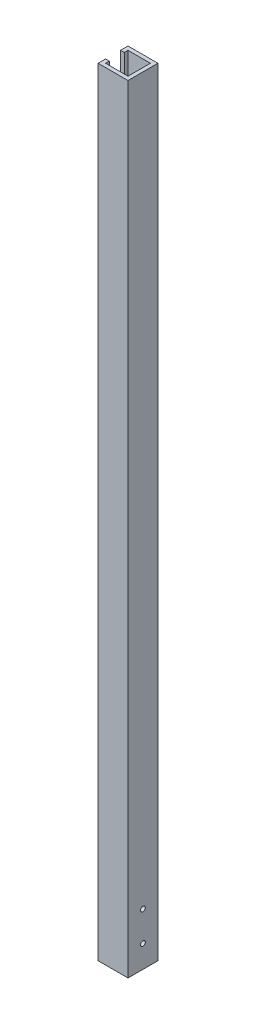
ISO-10303-21;
HEADER;
FILE_DESCRIPTION(('STEP AP214'),'2;1');
FILE_NAME('part.step','',(''),(''),'','','');
FILE_SCHEMA(('AUTOMOTIVE_DESIGN { 1 0 10303 214 1 1 1 1 }'));
ENDSEC;
DATA;
#1=APPLICATION_CONTEXT('core data for automotive mechanical design processes');
#2=APPLICATION_PROTOCOL_DEFINITION('international standard','automotive_design',2000,#1);
#3=PRODUCT_CONTEXT('',#1,'mechanical');
#4=PRODUCT('Part','Part','',(#3));
#5=PRODUCT_RELATED_PRODUCT_CATEGORY('part','',(#4));
#6=PRODUCT_DEFINITION_FORMATION('','',#4);
#7=PRODUCT_DEFINITION_CONTEXT('part definition',#1,'design');
#8=PRODUCT_DEFINITION('design','',#6,#7);
#9=PRODUCT_DEFINITION_SHAPE('','',#8);
#10=(LENGTH_UNIT() NAMED_UNIT(*) SI_UNIT(.MILLI.,.METRE.));
#11=(NAMED_UNIT(*) PLANE_ANGLE_UNIT() SI_UNIT($,.RADIAN.));
#12=(NAMED_UNIT(*) SI_UNIT($,.STERADIAN.) SOLID_ANGLE_UNIT());
#13=UNCERTAINTY_MEASURE_WITH_UNIT(LENGTH_MEASURE(1.E-05),#10,'distance_accuracy_value','');
#14=(GEOMETRIC_REPRESENTATION_CONTEXT(3) GLOBAL_UNCERTAINTY_ASSIGNED_CONTEXT((#13)) GLOBAL_UNIT_ASSIGNED_CONTEXT((#10,
#11,#12)) REPRESENTATION_CONTEXT('',''));
#15=CARTESIAN_POINT('',(0.,0.,0.));
#16=DIRECTION('',(0.,0.,1.));
#17=DIRECTION('',(1.,0.,0.));
#18=AXIS2_PLACEMENT_3D('',#15,#16,#17);
#19=CARTESIAN_POINT('',(0.,660.4,0.));
#20=DIRECTION('',(0.,-1.,0.));
#21=DIRECTION('',(0.,0.,-1.));
#22=AXIS2_PLACEMENT_3D('',#19,#20,#21);
#23=PLANE('',#22);
#24=DIRECTION('',(0.,0.,1.));
#25=VECTOR('',#24,1.);
#26=CARTESIAN_POINT('',(-9.525,660.4,9.525));
#27=LINE('',#26,#25);
#28=CARTESIAN_POINT('',(-9.525,660.4,6.34999999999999));
#29=VERTEX_POINT('',#28);
#30=CARTESIAN_POINT('',(-9.525,660.4,9.525));
#31=VERTEX_POINT('',#30);
#32=EDGE_CURVE('E228',#29,#31,#27,.T.);
#33=ORIENTED_EDGE('',*,*,#32,.F.);
#34=DIRECTION('',(-1.,0.,0.));
#35=VECTOR('',#34,1.);
#36=CARTESIAN_POINT('',(-9.525,660.4,6.34999999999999));
#37=LINE('',#36,#35);
#38=CARTESIAN_POINT('',(-12.7,660.4,6.34999999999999));
#39=VERTEX_POINT('',#38);
#40=EDGE_CURVE('E312',#29,#39,#37,.T.);
#41=ORIENTED_EDGE('',*,*,#40,.T.);
#42=DIRECTION('',(0.,0.,1.));
#43=VECTOR('',#42,1.);
#44=CARTESIAN_POINT('',(-12.7,660.4,12.7));
#45=LINE('',#44,#43);
#46=CARTESIAN_POINT('',(-12.7,660.4,12.7));
#47=VERTEX_POINT('',#46);
#48=EDGE_CURVE('E262',#39,#47,#45,.T.);
#49=ORIENTED_EDGE('',*,*,#48,.T.);
#50=DIRECTION('',(1.,0.,0.));
#51=VECTOR('',#50,1.);
#52=CARTESIAN_POINT('',(-12.7,660.4,12.7));
#53=LINE('',#52,#51);
#54=CARTESIAN_POINT('',(12.7,660.4,12.7));
#55=VERTEX_POINT('',#54);
#56=EDGE_CURVE('E199',#47,#55,#53,.T.);
#57=ORIENTED_EDGE('',*,*,#56,.T.);
#58=DIRECTION('',(0.,0.,-1.));
#59=VECTOR('',#58,1.);
#60=CARTESIAN_POINT('',(12.7,660.4,12.7));
#61=LINE('',#60,#59);
#62=CARTESIAN_POINT('',(12.7,660.4,-12.7));
#63=VERTEX_POINT('',#62);
#64=EDGE_CURVE('E194',#55,#63,#61,.T.);
#65=ORIENTED_EDGE('',*,*,#64,.T.);
#66=DIRECTION('',(-1.,0.,0.));
#67=VECTOR('',#66,1.);
#68=CARTESIAN_POINT('',(-12.7,660.4,-12.7));
#69=LINE('',#68,#67);
#70=CARTESIAN_POINT('',(-12.7,660.4,-12.7));
#71=VERTEX_POINT('',#70);
#72=EDGE_CURVE('E260',#63,#71,#69,.T.);
#73=ORIENTED_EDGE('',*,*,#72,.T.);
#74=CARTESIAN_POINT('',(-12.7,660.4,-6.35));
#75=VERTEX_POINT('',#74);
#76=EDGE_CURVE('E263',#71,#75,#45,.T.);
#77=ORIENTED_EDGE('',*,*,#76,.T.);
#78=DIRECTION('',(-1.,0.,0.));
#79=VECTOR('',#78,1.);
#80=CARTESIAN_POINT('',(-9.525,660.4,-6.35));
#81=LINE('',#80,#79);
#82=CARTESIAN_POINT('',(-9.525,660.4,-6.35));
#83=VERTEX_POINT('',#82);
#84=EDGE_CURVE('E329',#83,#75,#81,.T.);
#85=ORIENTED_EDGE('',*,*,#84,.F.);
#86=CARTESIAN_POINT('',(-9.525,660.4,-9.525));
#87=VERTEX_POINT('',#86);
#88=EDGE_CURVE('E224',#87,#83,#27,.T.);
#89=ORIENTED_EDGE('',*,*,#88,.F.);
#90=DIRECTION('',(-1.,0.,0.));
#91=VECTOR('',#90,1.);
#92=CARTESIAN_POINT('',(-9.525,660.4,-9.525));
#93=LINE('',#92,#91);
#94=CARTESIAN_POINT('',(9.525,660.4,-9.52500000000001));
#95=VERTEX_POINT('',#94);
#96=EDGE_CURVE('E233',#95,#87,#93,.T.);
#97=ORIENTED_EDGE('',*,*,#96,.F.);
#98=DIRECTION('',(0.,0.,-1.));
#99=VECTOR('',#98,1.);
#100=CARTESIAN_POINT('',(9.525,660.4,9.525));
#101=LINE('',#100,#99);
#102=CARTESIAN_POINT('',(9.525,660.4,9.525));
#103=VERTEX_POINT('',#102);
#104=EDGE_CURVE('E230',#103,#95,#101,.T.);
#105=ORIENTED_EDGE('',*,*,#104,.F.);
#106=DIRECTION('',(1.,0.,0.));
#107=VECTOR('',#106,1.);
#108=CARTESIAN_POINT('',(-9.525,660.4,9.525));
#109=LINE('',#108,#107);
#110=EDGE_CURVE('E227',#31,#103,#109,.T.);
#111=ORIENTED_EDGE('',*,*,#110,.F.);
#112=EDGE_LOOP('',(#33,#41,#49,#57,#65,#73,#77,#85,#89,#97,#105,#111));
#113=FACE_BOUND('',#112,.T.);
#114=ADVANCED_FACE('F40',(#113),#23,.F.);
#115=CARTESIAN_POINT('',(0.,0.,0.));
#116=DIRECTION('',(0.,-1.,0.));
#117=DIRECTION('',(0.,0.,-1.));
#118=AXIS2_PLACEMENT_3D('',#115,#116,#117);
#119=PLANE('',#118);
#120=DIRECTION('',(0.,0.,1.));
#121=VECTOR('',#120,1.);
#122=CARTESIAN_POINT('',(-8.89,0.,12.701));
#123=LINE('',#122,#121);
#124=CARTESIAN_POINT('',(-8.89,0.,-12.7));
#125=VERTEX_POINT('',#124);
#126=CARTESIAN_POINT('',(-8.89,0.,-9.525));
#127=VERTEX_POINT('',#126);
#128=EDGE_CURVE('E179',#125,#127,#123,.T.);
#129=ORIENTED_EDGE('',*,*,#128,.T.);
#130=DIRECTION('',(-1.,0.,0.));
#131=VECTOR('',#130,1.);
#132=CARTESIAN_POINT('',(-9.525,0.,-9.525));
#133=LINE('',#132,#131);
#134=CARTESIAN_POINT('',(-9.525,0.,-9.525));
#135=VERTEX_POINT('',#134);
#136=EDGE_CURVE('E243',#127,#135,#133,.T.);
#137=ORIENTED_EDGE('',*,*,#136,.T.);
#138=DIRECTION('',(0.,0.,1.));
#139=VECTOR('',#138,1.);
#140=CARTESIAN_POINT('',(-9.525,0.,9.525));
#141=LINE('',#140,#139);
#142=CARTESIAN_POINT('',(-9.525,0.,9.525));
#143=VERTEX_POINT('',#142);
#144=EDGE_CURVE('E212',#135,#143,#141,.T.);
#145=ORIENTED_EDGE('',*,*,#144,.T.);
#146=DIRECTION('',(1.,0.,0.));
#147=VECTOR('',#146,1.);
#148=CARTESIAN_POINT('',(-9.525,0.,9.525));
#149=LINE('',#148,#147);
#150=CARTESIAN_POINT('',(9.525,0.,9.525));
#151=VERTEX_POINT('',#150);
#152=EDGE_CURVE('E238',#143,#151,#149,.T.);
#153=ORIENTED_EDGE('',*,*,#152,.T.);
#154=DIRECTION('',(0.,0.,-1.));
#155=VECTOR('',#154,1.);
#156=CARTESIAN_POINT('',(9.525,0.,9.525));
#157=LINE('',#156,#155);
#158=CARTESIAN_POINT('',(9.525,0.,-9.52500000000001));
#159=VERTEX_POINT('',#158);
#160=EDGE_CURVE('E241',#151,#159,#157,.T.);
#161=ORIENTED_EDGE('',*,*,#160,.T.);
#162=CARTESIAN_POINT('',(8.88999999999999,0.,-9.52500000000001));
#163=VERTEX_POINT('',#162);
#164=EDGE_CURVE('E177',#159,#163,#133,.T.);
#165=ORIENTED_EDGE('',*,*,#164,.T.);
#166=DIRECTION('',(0.,0.,-1.));
#167=VECTOR('',#166,1.);
#168=CARTESIAN_POINT('',(8.89,0.,12.701));
#169=LINE('',#168,#167);
#170=CARTESIAN_POINT('',(8.89,0.,-12.7));
#171=VERTEX_POINT('',#170);
#172=EDGE_CURVE('E58',#163,#171,#169,.T.);
#173=ORIENTED_EDGE('',*,*,#172,.T.);
#174=DIRECTION('',(-1.,0.,0.));
#175=VECTOR('',#174,1.);
#176=CARTESIAN_POINT('',(-12.7,0.,-12.7));
#177=LINE('',#176,#175);
#178=CARTESIAN_POINT('',(12.7,0.,-12.7));
#179=VERTEX_POINT('',#178);
#180=EDGE_CURVE('E174',#179,#171,#177,.T.);
#181=ORIENTED_EDGE('',*,*,#180,.F.);
#182=DIRECTION('',(0.,0.,-1.));
#183=VECTOR('',#182,1.);
#184=CARTESIAN_POINT('',(12.7,0.,12.7));
#185=LINE('',#184,#183);
#186=CARTESIAN_POINT('',(12.7,0.,12.7));
#187=VERTEX_POINT('',#186);
#188=EDGE_CURVE('E189',#187,#179,#185,.T.);
#189=ORIENTED_EDGE('',*,*,#188,.F.);
#190=DIRECTION('',(1.,0.,0.));
#191=VECTOR('',#190,1.);
#192=CARTESIAN_POINT('',(-12.7,0.,12.7));
#193=LINE('',#192,#191);
#194=CARTESIAN_POINT('',(-12.7,0.,12.7));
#195=VERTEX_POINT('',#194);
#196=EDGE_CURVE('E187',#195,#187,#193,.T.);
#197=ORIENTED_EDGE('',*,*,#196,.F.);
#198=DIRECTION('',(0.,0.,1.));
#199=VECTOR('',#198,1.);
#200=CARTESIAN_POINT('',(-12.7,0.,12.7));
#201=LINE('',#200,#199);
#202=CARTESIAN_POINT('',(-12.7,0.,-12.7));
#203=VERTEX_POINT('',#202);
#204=EDGE_CURVE('E184',#203,#195,#201,.T.);
#205=ORIENTED_EDGE('',*,*,#204,.F.);
#206=EDGE_CURVE('E185',#125,#203,#177,.T.);
#207=ORIENTED_EDGE('',*,*,#206,.F.);
#208=EDGE_LOOP('',(#129,#137,#145,#153,#161,#165,#173,#181,#189,#197,#205,#207));
#209=FACE_BOUND('',#208,.T.);
#210=ADVANCED_FACE('F172',(#209),#119,.T.);
#211=CARTESIAN_POINT('',(12.7,660.4,12.7));
#212=DIRECTION('',(-1.,0.,0.));
#213=DIRECTION('',(0.,0.,1.));
#214=AXIS2_PLACEMENT_3D('',#211,#212,#213);
#215=PLANE('',#214);
#216=CARTESIAN_POINT('',(12.7,44.45,0.));
#217=DIRECTION('',(1.,0.,0.));
#218=DIRECTION('',(0.,0.,-1.));
#219=AXIS2_PLACEMENT_3D('',#216,#217,#218);
#220=CIRCLE('',#219,2.01929999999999);
#221=CARTESIAN_POINT('',(12.7,44.45,-2.01929999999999));
#222=VERTEX_POINT('',#221);
#223=EDGE_CURVE('E325',#222,#222,#220,.T.);
#224=ORIENTED_EDGE('',*,*,#223,.F.);
#225=EDGE_LOOP('',(#224));
#226=FACE_BOUND('',#225,.T.);
#227=CARTESIAN_POINT('',(12.7,19.05,0.));
#228=DIRECTION('',(1.,0.,0.));
#229=DIRECTION('',(0.,0.,-1.));
#230=AXIS2_PLACEMENT_3D('',#227,#228,#229);
#231=CIRCLE('',#230,2.01929999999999);
#232=CARTESIAN_POINT('',(12.7,19.05,-2.01929999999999));
#233=VERTEX_POINT('',#232);
#234=EDGE_CURVE('E215',#233,#233,#231,.T.);
#235=ORIENTED_EDGE('',*,*,#234,.F.);
#236=EDGE_LOOP('',(#235));
#237=FACE_BOUND('',#236,.T.);
#238=ORIENTED_EDGE('',*,*,#188,.T.);
#239=DIRECTION('',(0.,-1.,0.));
#240=VECTOR('',#239,1.);
#241=CARTESIAN_POINT('',(12.7,660.4,-12.7));
#242=LINE('',#241,#240);
#243=EDGE_CURVE('E11',#63,#179,#242,.T.);
#244=ORIENTED_EDGE('',*,*,#243,.F.);
#245=ORIENTED_EDGE('',*,*,#64,.F.);
#246=DIRECTION('',(0.,-1.,0.));
#247=VECTOR('',#246,1.);
#248=CARTESIAN_POINT('',(12.7,660.4,12.7));
#249=LINE('',#248,#247);
#250=EDGE_CURVE('E195',#55,#187,#249,.T.);
#251=ORIENTED_EDGE('',*,*,#250,.T.);
#252=EDGE_LOOP('',(#238,#244,#245,#251));
#253=FACE_BOUND('',#252,.T.);
#254=ADVANCED_FACE('F42',(#226,#237,#253),#215,.F.);
#255=CARTESIAN_POINT('',(-12.7,660.4,-12.7));
#256=DIRECTION('',(0.,0.,1.));
#257=DIRECTION('',(1.,0.,0.));
#258=AXIS2_PLACEMENT_3D('',#255,#256,#257);
#259=PLANE('',#258);
#260=CARTESIAN_POINT('',(0.,25.4,-12.7));
#261=DIRECTION('',(0.,0.,-1.));
#262=DIRECTION('',(-1.,0.,0.));
#263=AXIS2_PLACEMENT_3D('',#260,#261,#262);
#264=CIRCLE('',#263,8.89);
#265=CARTESIAN_POINT('',(-8.89,25.4,-12.7));
#266=VERTEX_POINT('',#265);
#267=CARTESIAN_POINT('',(8.89,25.4,-12.7));
#268=VERTEX_POINT('',#267);
#269=EDGE_CURVE('E167',#266,#268,#264,.T.);
#270=ORIENTED_EDGE('',*,*,#269,.F.);
#271=DIRECTION('',(0.,1.,0.));
#272=VECTOR('',#271,1.);
#273=CARTESIAN_POINT('',(-8.89,0.,-12.7));
#274=LINE('',#273,#272);
#275=EDGE_CURVE('E286',#125,#266,#274,.T.);
#276=ORIENTED_EDGE('',*,*,#275,.F.);
#277=ORIENTED_EDGE('',*,*,#206,.T.);
#278=DIRECTION('',(0.,-1.,0.));
#279=VECTOR('',#278,1.);
#280=CARTESIAN_POINT('',(-12.7,660.4,-12.7));
#281=LINE('',#280,#279);
#282=EDGE_CURVE('E50',#71,#203,#281,.T.);
#283=ORIENTED_EDGE('',*,*,#282,.F.);
#284=ORIENTED_EDGE('',*,*,#72,.F.);
#285=ORIENTED_EDGE('',*,*,#243,.T.);
#286=ORIENTED_EDGE('',*,*,#180,.T.);
#287=DIRECTION('',(0.,-1.,0.));
#288=VECTOR('',#287,1.);
#289=CARTESIAN_POINT('',(8.89,0.,-12.7));
#290=LINE('',#289,#288);
#291=EDGE_CURVE('E158',#268,#171,#290,.T.);
#292=ORIENTED_EDGE('',*,*,#291,.F.);
#293=EDGE_LOOP('',(#270,#276,#277,#283,#284,#285,#286,#292));
#294=FACE_BOUND('',#293,.T.);
#295=ADVANCED_FACE('F181',(#294),#259,.F.);
#296=CARTESIAN_POINT('',(-12.7,660.4,12.7));
#297=DIRECTION('',(1.,0.,0.));
#298=DIRECTION('',(0.,0.,-1.));
#299=AXIS2_PLACEMENT_3D('',#296,#297,#298);
#300=PLANE('',#299);
#301=CARTESIAN_POINT('',(-12.7,44.45,0.));
#302=DIRECTION('',(1.,0.,0.));
#303=DIRECTION('',(0.,0.,-1.));
#304=AXIS2_PLACEMENT_3D('',#301,#302,#303);
#305=CIRCLE('',#304,2.01929999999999);
#306=CARTESIAN_POINT('',(-12.7,44.45,-2.01929999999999));
#307=VERTEX_POINT('',#306);
#308=EDGE_CURVE('E334',#307,#307,#305,.T.);
#309=ORIENTED_EDGE('',*,*,#308,.T.);
#310=EDGE_LOOP('',(#309));
#311=FACE_BOUND('',#310,.T.);
#312=CARTESIAN_POINT('',(-12.7,19.05,0.));
#313=DIRECTION('',(1.,0.,0.));
#314=DIRECTION('',(0.,0.,-1.));
#315=AXIS2_PLACEMENT_3D('',#312,#313,#314);
#316=CIRCLE('',#315,2.01929999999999);
#317=CARTESIAN_POINT('',(-12.7,19.05,-2.01929999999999));
#318=VERTEX_POINT('',#317);
#319=EDGE_CURVE('E208',#318,#318,#316,.T.);
#320=ORIENTED_EDGE('',*,*,#319,.T.);
#321=EDGE_LOOP('',(#320));
#322=FACE_BOUND('',#321,.T.);
#323=ORIENTED_EDGE('',*,*,#48,.F.);
#324=DIRECTION('',(0.,1.,0.));
#325=VECTOR('',#324,1.);
#326=CARTESIAN_POINT('',(-12.7,660.4,6.34999999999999));
#327=LINE('',#326,#325);
#328=CARTESIAN_POINT('',(-12.7,596.9,6.35));
#329=VERTEX_POINT('',#328);
#330=EDGE_CURVE('E300',#329,#39,#327,.T.);
#331=ORIENTED_EDGE('',*,*,#330,.F.);
#332=DIRECTION('',(0.,0.,1.));
#333=VECTOR('',#332,1.);
#334=CARTESIAN_POINT('',(-12.7,596.9,6.35));
#335=LINE('',#334,#333);
#336=CARTESIAN_POINT('',(-12.7,596.9,-6.34999999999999));
#337=VERTEX_POINT('',#336);
#338=EDGE_CURVE('E306',#337,#329,#335,.T.);
#339=ORIENTED_EDGE('',*,*,#338,.F.);
#340=DIRECTION('',(0.,-1.,0.));
#341=VECTOR('',#340,1.);
#342=CARTESIAN_POINT('',(-12.7,660.4,-6.35));
#343=LINE('',#342,#341);
#344=EDGE_CURVE('E315',#75,#337,#343,.T.);
#345=ORIENTED_EDGE('',*,*,#344,.F.);
#346=ORIENTED_EDGE('',*,*,#76,.F.);
#347=ORIENTED_EDGE('',*,*,#282,.T.);
#348=ORIENTED_EDGE('',*,*,#204,.T.);
#349=DIRECTION('',(0.,-1.,0.));
#350=VECTOR('',#349,1.);
#351=CARTESIAN_POINT('',(-12.7,660.4,12.7));
#352=LINE('',#351,#350);
#353=EDGE_CURVE('E198',#47,#195,#352,.T.);
#354=ORIENTED_EDGE('',*,*,#353,.F.);
#355=EDGE_LOOP('',(#323,#331,#339,#345,#346,#347,#348,#354));
#356=FACE_BOUND('',#355,.T.);
#357=ADVANCED_FACE('F280',(#311,#322,#356),#300,.F.);
#358=CARTESIAN_POINT('',(-12.7,660.4,12.7));
#359=DIRECTION('',(0.,0.,-1.));
#360=DIRECTION('',(-1.,0.,0.));
#361=AXIS2_PLACEMENT_3D('',#358,#359,#360);
#362=PLANE('',#361);
#363=ORIENTED_EDGE('',*,*,#196,.T.);
#364=ORIENTED_EDGE('',*,*,#250,.F.);
#365=ORIENTED_EDGE('',*,*,#56,.F.);
#366=ORIENTED_EDGE('',*,*,#353,.T.);
#367=EDGE_LOOP('',(#363,#364,#365,#366));
#368=FACE_BOUND('',#367,.T.);
#369=ADVANCED_FACE('F274',(#368),#362,.F.);
#370=CARTESIAN_POINT('',(-9.525,660.4,9.525));
#371=DIRECTION('',(1.,0.,0.));
#372=DIRECTION('',(0.,0.,-1.));
#373=AXIS2_PLACEMENT_3D('',#370,#371,#372);
#374=PLANE('',#373);
#375=DIRECTION('',(0.,1.,0.));
#376=VECTOR('',#375,1.);
#377=CARTESIAN_POINT('',(-9.525,660.4,6.34999999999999));
#378=LINE('',#377,#376);
#379=CARTESIAN_POINT('',(-9.525,596.9,6.35));
#380=VERTEX_POINT('',#379);
#381=EDGE_CURVE('E301',#380,#29,#378,.T.);
#382=ORIENTED_EDGE('',*,*,#381,.T.);
#383=ORIENTED_EDGE('',*,*,#32,.T.);
#384=DIRECTION('',(0.,-1.,0.));
#385=VECTOR('',#384,1.);
#386=CARTESIAN_POINT('',(-9.525,660.4,9.525));
#387=LINE('',#386,#385);
#388=EDGE_CURVE('E254',#31,#143,#387,.T.);
#389=ORIENTED_EDGE('',*,*,#388,.T.);
#390=ORIENTED_EDGE('',*,*,#144,.F.);
#391=DIRECTION('',(0.,-1.,0.));
#392=VECTOR('',#391,1.);
#393=CARTESIAN_POINT('',(-9.525,660.4,-9.525));
#394=LINE('',#393,#392);
#395=EDGE_CURVE('E235',#87,#135,#394,.T.);
#396=ORIENTED_EDGE('',*,*,#395,.F.);
#397=ORIENTED_EDGE('',*,*,#88,.T.);
#398=DIRECTION('',(0.,-1.,0.));
#399=VECTOR('',#398,1.);
#400=CARTESIAN_POINT('',(-9.525,660.4,-6.35));
#401=LINE('',#400,#399);
#402=CARTESIAN_POINT('',(-9.525,596.9,-6.34999999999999));
#403=VERTEX_POINT('',#402);
#404=EDGE_CURVE('E305',#83,#403,#401,.T.);
#405=ORIENTED_EDGE('',*,*,#404,.T.);
#406=DIRECTION('',(0.,0.,1.));
#407=VECTOR('',#406,1.);
#408=CARTESIAN_POINT('',(-9.525,596.9,6.35));
#409=LINE('',#408,#407);
#410=EDGE_CURVE('E68',#403,#380,#409,.T.);
#411=ORIENTED_EDGE('',*,*,#410,.T.);
#412=EDGE_LOOP('',(#382,#383,#389,#390,#396,#397,#405,#411));
#413=FACE_BOUND('',#412,.T.);
#414=CARTESIAN_POINT('',(-9.525,44.45,0.));
#415=DIRECTION('',(1.,0.,0.));
#416=DIRECTION('',(0.,0.,-1.));
#417=AXIS2_PLACEMENT_3D('',#414,#415,#416);
#418=CIRCLE('',#417,2.01929999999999);
#419=CARTESIAN_POINT('',(-9.525,44.45,-2.01929999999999));
#420=VERTEX_POINT('',#419);
#421=EDGE_CURVE('E220',#420,#420,#418,.T.);
#422=ORIENTED_EDGE('',*,*,#421,.F.);
#423=EDGE_LOOP('',(#422));
#424=FACE_BOUND('',#423,.T.);
#425=CARTESIAN_POINT('',(-9.525,19.05,0.));
#426=DIRECTION('',(1.,0.,0.));
#427=DIRECTION('',(0.,0.,-1.));
#428=AXIS2_PLACEMENT_3D('',#425,#426,#427);
#429=CIRCLE('',#428,2.01929999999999);
#430=CARTESIAN_POINT('',(-9.525,19.05,-2.01929999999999));
#431=VERTEX_POINT('',#430);
#432=EDGE_CURVE('E207',#431,#431,#429,.T.);
#433=ORIENTED_EDGE('',*,*,#432,.F.);
#434=EDGE_LOOP('',(#433));
#435=FACE_BOUND('',#434,.T.);
#436=ADVANCED_FACE('F360',(#413,#424,#435),#374,.T.);
#437=CARTESIAN_POINT('',(-9.525,660.4,9.525));
#438=DIRECTION('',(0.,0.,-1.));
#439=DIRECTION('',(-1.,0.,0.));
#440=AXIS2_PLACEMENT_3D('',#437,#438,#439);
#441=PLANE('',#440);
#442=ORIENTED_EDGE('',*,*,#152,.F.);
#443=ORIENTED_EDGE('',*,*,#388,.F.);
#444=ORIENTED_EDGE('',*,*,#110,.T.);
#445=DIRECTION('',(0.,-1.,0.));
#446=VECTOR('',#445,1.);
#447=CARTESIAN_POINT('',(9.525,660.4,9.525));
#448=LINE('',#447,#446);
#449=EDGE_CURVE('E251',#103,#151,#448,.T.);
#450=ORIENTED_EDGE('',*,*,#449,.T.);
#451=EDGE_LOOP('',(#442,#443,#444,#450));
#452=FACE_BOUND('',#451,.T.);
#453=ADVANCED_FACE('F349',(#452),#441,.T.);
#454=CARTESIAN_POINT('',(9.525,660.4,9.525));
#455=DIRECTION('',(-1.,0.,0.));
#456=DIRECTION('',(0.,0.,1.));
#457=AXIS2_PLACEMENT_3D('',#454,#455,#456);
#458=PLANE('',#457);
#459=CARTESIAN_POINT('',(9.525,44.45,0.));
#460=DIRECTION('',(-1.,0.,0.));
#461=DIRECTION('',(0.,0.,1.));
#462=AXIS2_PLACEMENT_3D('',#459,#460,#461);
#463=CIRCLE('',#462,2.01929999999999);
#464=CARTESIAN_POINT('',(9.525,44.45,2.01929999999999));
#465=VERTEX_POINT('',#464);
#466=EDGE_CURVE('E44',#465,#465,#463,.T.);
#467=ORIENTED_EDGE('',*,*,#466,.F.);
#468=EDGE_LOOP('',(#467));
#469=FACE_BOUND('',#468,.T.);
#470=CARTESIAN_POINT('',(9.525,19.05,0.));
#471=DIRECTION('',(-1.,0.,0.));
#472=DIRECTION('',(0.,0.,1.));
#473=AXIS2_PLACEMENT_3D('',#470,#471,#472);
#474=CIRCLE('',#473,2.01929999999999);
#475=CARTESIAN_POINT('',(9.525,19.05,2.01929999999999));
#476=VERTEX_POINT('',#475);
#477=EDGE_CURVE('E205',#476,#476,#474,.T.);
#478=ORIENTED_EDGE('',*,*,#477,.F.);
#479=EDGE_LOOP('',(#478));
#480=FACE_BOUND('',#479,.T.);
#481=ORIENTED_EDGE('',*,*,#160,.F.);
#482=ORIENTED_EDGE('',*,*,#449,.F.);
#483=ORIENTED_EDGE('',*,*,#104,.T.);
#484=DIRECTION('',(0.,-1.,0.));
#485=VECTOR('',#484,1.);
#486=CARTESIAN_POINT('',(9.525,660.4,-9.52500000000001));
#487=LINE('',#486,#485);
#488=EDGE_CURVE('E248',#95,#159,#487,.T.);
#489=ORIENTED_EDGE('',*,*,#488,.T.);
#490=EDGE_LOOP('',(#481,#482,#483,#489));
#491=FACE_BOUND('',#490,.T.);
#492=ADVANCED_FACE('F345',(#469,#480,#491),#458,.T.);
#493=CARTESIAN_POINT('',(-9.525,660.4,-9.525));
#494=DIRECTION('',(0.,0.,1.));
#495=DIRECTION('',(1.,0.,0.));
#496=AXIS2_PLACEMENT_3D('',#493,#494,#495);
#497=PLANE('',#496);
#498=DIRECTION('',(0.,1.,0.));
#499=VECTOR('',#498,1.);
#500=CARTESIAN_POINT('',(-8.89,0.,-9.525));
#501=LINE('',#500,#499);
#502=CARTESIAN_POINT('',(-8.89,25.4,-9.525));
#503=VERTEX_POINT('',#502);
#504=EDGE_CURVE('E296',#127,#503,#501,.T.);
#505=ORIENTED_EDGE('',*,*,#504,.T.);
#506=CARTESIAN_POINT('',(0.,25.4,-9.525));
#507=DIRECTION('',(0.,0.,1.));
#508=DIRECTION('',(1.,0.,0.));
#509=AXIS2_PLACEMENT_3D('',#506,#507,#508);
#510=CIRCLE('',#509,8.89);
#511=CARTESIAN_POINT('',(8.89,25.4,-9.525));
#512=VERTEX_POINT('',#511);
#513=EDGE_CURVE('E178',#503,#512,#510,.F.);
#514=ORIENTED_EDGE('',*,*,#513,.T.);
#515=DIRECTION('',(0.,-1.,0.));
#516=VECTOR('',#515,1.);
#517=CARTESIAN_POINT('',(8.89,0.,-9.52500000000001));
#518=LINE('',#517,#516);
#519=EDGE_CURVE('E289',#512,#163,#518,.T.);
#520=ORIENTED_EDGE('',*,*,#519,.T.);
#521=ORIENTED_EDGE('',*,*,#164,.F.);
#522=ORIENTED_EDGE('',*,*,#488,.F.);
#523=ORIENTED_EDGE('',*,*,#96,.T.);
#524=ORIENTED_EDGE('',*,*,#395,.T.);
#525=ORIENTED_EDGE('',*,*,#136,.F.);
#526=EDGE_LOOP('',(#505,#514,#520,#521,#522,#523,#524,#525));
#527=FACE_BOUND('',#526,.T.);
#528=ADVANCED_FACE('F348',(#527),#497,.T.);
#529=CARTESIAN_POINT('',(12.7,19.05,0.));
#530=DIRECTION('',(1.,0.,0.));
#531=DIRECTION('',(0.,0.,-1.));
#532=AXIS2_PLACEMENT_3D('',#529,#530,#531);
#533=CYLINDRICAL_SURFACE('',#532,2.01929999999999);
#534=ORIENTED_EDGE('',*,*,#477,.T.);
#535=EDGE_LOOP('',(#534));
#536=FACE_BOUND('',#535,.T.);
#537=ORIENTED_EDGE('',*,*,#234,.T.);
#538=EDGE_LOOP('',(#537));
#539=FACE_BOUND('',#538,.T.);
#540=ADVANCED_FACE('F413',(#536,#539),#533,.F.);
#541=ORIENTED_EDGE('',*,*,#432,.T.);
#542=EDGE_LOOP('',(#541));
#543=FACE_BOUND('',#542,.T.);
#544=ORIENTED_EDGE('',*,*,#319,.F.);
#545=EDGE_LOOP('',(#544));
#546=FACE_BOUND('',#545,.T.);
#547=ADVANCED_FACE('F415',(#543,#546),#533,.F.);
#548=CARTESIAN_POINT('',(12.7,44.45,0.));
#549=DIRECTION('',(1.,0.,0.));
#550=DIRECTION('',(0.,0.,-1.));
#551=AXIS2_PLACEMENT_3D('',#548,#549,#550);
#552=CYLINDRICAL_SURFACE('',#551,2.01929999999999);
#553=ORIENTED_EDGE('',*,*,#466,.T.);
#554=EDGE_LOOP('',(#553));
#555=FACE_BOUND('',#554,.T.);
#556=ORIENTED_EDGE('',*,*,#223,.T.);
#557=EDGE_LOOP('',(#556));
#558=FACE_BOUND('',#557,.T.);
#559=ADVANCED_FACE('F342',(#555,#558),#552,.F.);
#560=ORIENTED_EDGE('',*,*,#421,.T.);
#561=EDGE_LOOP('',(#560));
#562=FACE_BOUND('',#561,.T.);
#563=ORIENTED_EDGE('',*,*,#308,.F.);
#564=EDGE_LOOP('',(#563));
#565=FACE_BOUND('',#564,.T.);
#566=ADVANCED_FACE('F377',(#562,#565),#552,.F.);
#567=CARTESIAN_POINT('',(-9.525,660.4,6.34999999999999));
#568=DIRECTION('',(0.,0.,1.));
#569=DIRECTION('',(0.,-1.,0.));
#570=AXIS2_PLACEMENT_3D('',#567,#568,#569);
#571=PLANE('',#570);
#572=ORIENTED_EDGE('',*,*,#330,.T.);
#573=ORIENTED_EDGE('',*,*,#40,.F.);
#574=ORIENTED_EDGE('',*,*,#381,.F.);
#575=DIRECTION('',(-1.,0.,0.));
#576=VECTOR('',#575,1.);
#577=CARTESIAN_POINT('',(-9.525,596.9,6.35));
#578=LINE('',#577,#576);
#579=EDGE_CURVE('E322',#380,#329,#578,.T.);
#580=ORIENTED_EDGE('',*,*,#579,.T.);
#581=EDGE_LOOP('',(#572,#573,#574,#580));
#582=FACE_BOUND('',#581,.T.);
#583=ADVANCED_FACE('F375',(#582),#571,.F.);
#584=CARTESIAN_POINT('',(-9.525,596.9,6.35));
#585=DIRECTION('',(0.,-1.,0.));
#586=DIRECTION('',(0.,0.,-1.));
#587=AXIS2_PLACEMENT_3D('',#584,#585,#586);
#588=PLANE('',#587);
#589=ORIENTED_EDGE('',*,*,#338,.T.);
#590=ORIENTED_EDGE('',*,*,#579,.F.);
#591=ORIENTED_EDGE('',*,*,#410,.F.);
#592=DIRECTION('',(-1.,0.,0.));
#593=VECTOR('',#592,1.);
#594=CARTESIAN_POINT('',(-9.525,596.9,-6.34999999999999));
#595=LINE('',#594,#593);
#596=EDGE_CURVE('E326',#403,#337,#595,.T.);
#597=ORIENTED_EDGE('',*,*,#596,.T.);
#598=EDGE_LOOP('',(#589,#590,#591,#597));
#599=FACE_BOUND('',#598,.T.);
#600=ADVANCED_FACE('F372',(#599),#588,.F.);
#601=CARTESIAN_POINT('',(-9.525,660.4,-6.35));
#602=DIRECTION('',(0.,0.,-1.));
#603=DIRECTION('',(0.,1.,0.));
#604=AXIS2_PLACEMENT_3D('',#601,#602,#603);
#605=PLANE('',#604);
#606=ORIENTED_EDGE('',*,*,#344,.T.);
#607=ORIENTED_EDGE('',*,*,#596,.F.);
#608=ORIENTED_EDGE('',*,*,#404,.F.);
#609=ORIENTED_EDGE('',*,*,#84,.T.);
#610=EDGE_LOOP('',(#606,#607,#608,#609));
#611=FACE_BOUND('',#610,.T.);
#612=ADVANCED_FACE('F370',(#611),#605,.F.);
#613=CARTESIAN_POINT('',(-8.89,0.,12.701));
#614=DIRECTION('',(-1.,0.,0.));
#615=DIRECTION('',(0.,0.,1.));
#616=AXIS2_PLACEMENT_3D('',#613,#614,#615);
#617=PLANE('',#616);
#618=ORIENTED_EDGE('',*,*,#128,.F.);
#619=ORIENTED_EDGE('',*,*,#275,.T.);
#620=DIRECTION('',(0.,0.,-1.));
#621=VECTOR('',#620,1.);
#622=CARTESIAN_POINT('',(-8.89,25.4,12.701));
#623=LINE('',#622,#621);
#624=EDGE_CURVE('E166',#503,#266,#623,.T.);
#625=ORIENTED_EDGE('',*,*,#624,.F.);
#626=ORIENTED_EDGE('',*,*,#504,.F.);
#627=EDGE_LOOP('',(#618,#619,#625,#626));
#628=FACE_BOUND('',#627,.T.);
#629=ADVANCED_FACE('F449',(#628),#617,.F.);
#630=CARTESIAN_POINT('',(0.,25.4,12.701));
#631=DIRECTION('',(0.,0.,-1.));
#632=DIRECTION('',(-1.,0.,0.));
#633=AXIS2_PLACEMENT_3D('',#630,#631,#632);
#634=CYLINDRICAL_SURFACE('',#633,8.89);
#635=ORIENTED_EDGE('',*,*,#624,.T.);
#636=ORIENTED_EDGE('',*,*,#269,.T.);
#637=DIRECTION('',(0.,0.,-1.));
#638=VECTOR('',#637,1.);
#639=CARTESIAN_POINT('',(8.89,25.4,12.701));
#640=LINE('',#639,#638);
#641=EDGE_CURVE('E161',#512,#268,#640,.T.);
#642=ORIENTED_EDGE('',*,*,#641,.F.);
#643=ORIENTED_EDGE('',*,*,#513,.F.);
#644=EDGE_LOOP('',(#635,#636,#642,#643));
#645=FACE_BOUND('',#644,.T.);
#646=ADVANCED_FACE('F467',(#645),#634,.F.);
#647=CARTESIAN_POINT('',(8.89,0.,12.701));
#648=DIRECTION('',(1.,0.,0.));
#649=DIRECTION('',(0.,0.,-1.));
#650=AXIS2_PLACEMENT_3D('',#647,#648,#649);
#651=PLANE('',#650);
#652=ORIENTED_EDGE('',*,*,#641,.T.);
#653=ORIENTED_EDGE('',*,*,#291,.T.);
#654=ORIENTED_EDGE('',*,*,#172,.F.);
#655=ORIENTED_EDGE('',*,*,#519,.F.);
#656=EDGE_LOOP('',(#652,#653,#654,#655));
#657=FACE_BOUND('',#656,.T.);
#658=ADVANCED_FACE('F159',(#657),#651,.F.);
#659=CLOSED_SHELL('',(#114,#210,#254,#295,#357,#369,#436,#453,#492,#528,#540,#547,#559,#566,
#583,#600,#612,#629,#646,#658));
#660=MANIFOLD_SOLID_BREP('B2',#659);
#661=ADVANCED_BREP_SHAPE_REPRESENTATION('',(#18,#660),#14);
#662=SHAPE_DEFINITION_REPRESENTATION(#9,#661);
ENDSEC;
END-ISO-10303-21;
